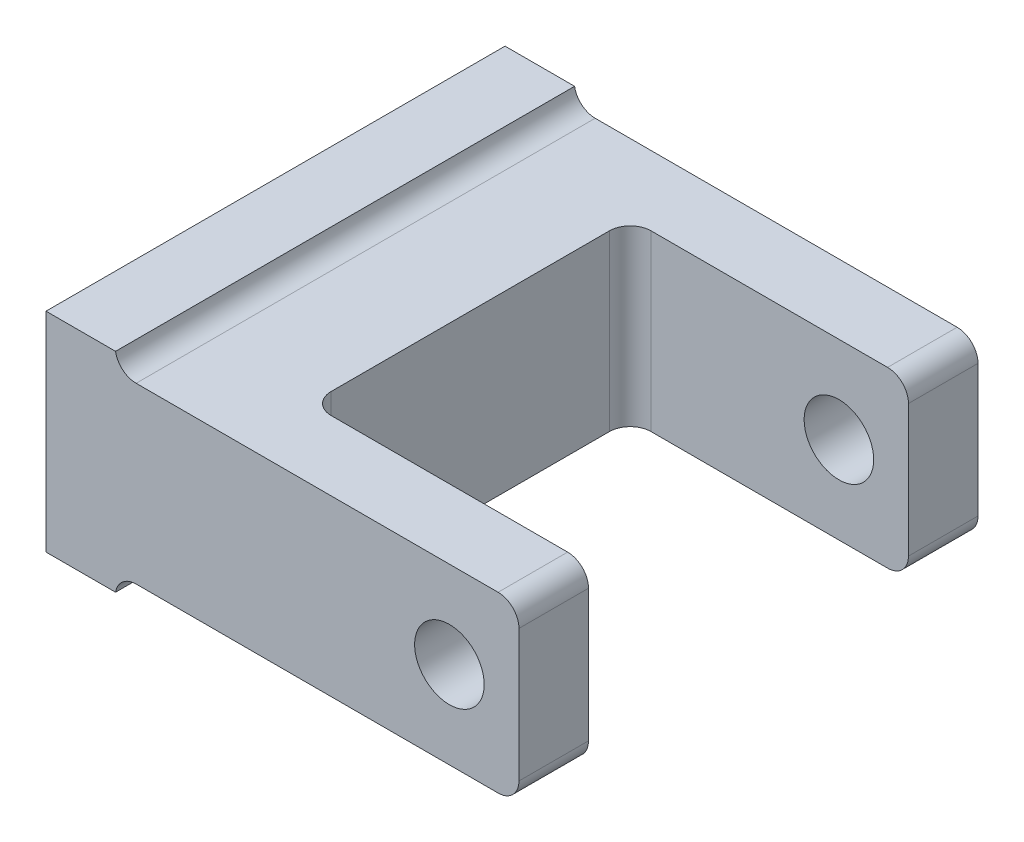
ISO-10303-21;
HEADER;
FILE_DESCRIPTION(('STEP AP214'),'2;1');
FILE_NAME('part.step','',(''),(''),'','','');
FILE_SCHEMA(('AUTOMOTIVE_DESIGN { 1 0 10303 214 1 1 1 1 }'));
ENDSEC;
DATA;
#1=APPLICATION_CONTEXT('core data for automotive mechanical design processes');
#2=APPLICATION_PROTOCOL_DEFINITION('international standard','automotive_design',2000,#1);
#3=PRODUCT_CONTEXT('',#1,'mechanical');
#4=PRODUCT('Part','Part','',(#3));
#5=PRODUCT_RELATED_PRODUCT_CATEGORY('part','',(#4));
#6=PRODUCT_DEFINITION_FORMATION('','',#4);
#7=PRODUCT_DEFINITION_CONTEXT('part definition',#1,'design');
#8=PRODUCT_DEFINITION('design','',#6,#7);
#9=PRODUCT_DEFINITION_SHAPE('','',#8);
#10=(LENGTH_UNIT() NAMED_UNIT(*) SI_UNIT(.MILLI.,.METRE.));
#11=(NAMED_UNIT(*) PLANE_ANGLE_UNIT() SI_UNIT($,.RADIAN.));
#12=(NAMED_UNIT(*) SI_UNIT($,.STERADIAN.) SOLID_ANGLE_UNIT());
#13=UNCERTAINTY_MEASURE_WITH_UNIT(LENGTH_MEASURE(1.E-05),#10,'distance_accuracy_value','');
#14=(GEOMETRIC_REPRESENTATION_CONTEXT(3) GLOBAL_UNCERTAINTY_ASSIGNED_CONTEXT((#13)) GLOBAL_UNIT_ASSIGNED_CONTEXT((#10,
#11,#12)) REPRESENTATION_CONTEXT('',''));
#15=CARTESIAN_POINT('',(0.,0.,0.));
#16=DIRECTION('',(0.,0.,1.));
#17=DIRECTION('',(1.,0.,0.));
#18=AXIS2_PLACEMENT_3D('',#15,#16,#17);
#19=CARTESIAN_POINT('',(34.,12.5,66.));
#20=DIRECTION('',(-1.,0.,0.));
#21=DIRECTION('',(0.,0.,1.));
#22=AXIS2_PLACEMENT_3D('',#19,#20,#21);
#23=PLANE('',#22);
#24=DIRECTION('',(0.,1.,0.));
#25=VECTOR('',#24,1.);
#26=CARTESIAN_POINT('',(34.,12.5,66.));
#27=LINE('',#26,#25);
#28=CARTESIAN_POINT('',(34.,-9.5,66.));
#29=VERTEX_POINT('',#28);
#30=CARTESIAN_POINT('',(34.,9.5,66.));
#31=VERTEX_POINT('',#30);
#32=EDGE_CURVE('E348',#29,#31,#27,.T.);
#33=ORIENTED_EDGE('',*,*,#32,.F.);
#34=DIRECTION('',(0.,0.,-1.));
#35=VECTOR('',#34,1.);
#36=CARTESIAN_POINT('',(34.,-9.5,66.));
#37=LINE('',#36,#35);
#38=CARTESIAN_POINT('',(34.,-9.5,56.));
#39=VERTEX_POINT('',#38);
#40=EDGE_CURVE('E246',#29,#39,#37,.T.);
#41=ORIENTED_EDGE('',*,*,#40,.T.);
#42=DIRECTION('',(0.,-1.,0.));
#43=VECTOR('',#42,1.);
#44=CARTESIAN_POINT('',(34.,12.5,56.));
#45=LINE('',#44,#43);
#46=CARTESIAN_POINT('',(34.,9.5,56.));
#47=VERTEX_POINT('',#46);
#48=EDGE_CURVE('E330',#47,#39,#45,.T.);
#49=ORIENTED_EDGE('',*,*,#48,.F.);
#50=DIRECTION('',(0.,0.,-1.));
#51=VECTOR('',#50,1.);
#52=CARTESIAN_POINT('',(34.,9.5,66.));
#53=LINE('',#52,#51);
#54=EDGE_CURVE('E56',#47,#31,#53,.F.);
#55=ORIENTED_EDGE('',*,*,#54,.T.);
#56=EDGE_LOOP('',(#33,#41,#49,#55));
#57=FACE_BOUND('',#56,.T.);
#58=ADVANCED_FACE('F39',(#57),#23,.F.);
#59=CARTESIAN_POINT('',(-34.,-15.,66.));
#60=DIRECTION('',(1.,0.,0.));
#61=DIRECTION('',(0.,0.,-1.));
#62=AXIS2_PLACEMENT_3D('',#59,#60,#61);
#63=PLANE('',#62);
#64=DIRECTION('',(0.,-1.,0.));
#65=VECTOR('',#64,1.);
#66=CARTESIAN_POINT('',(-34.,-15.,0.));
#67=LINE('',#66,#65);
#68=CARTESIAN_POINT('',(-34.,15.,0.));
#69=VERTEX_POINT('',#68);
#70=CARTESIAN_POINT('',(-34.,-15.,0.));
#71=VERTEX_POINT('',#70);
#72=EDGE_CURVE('E193',#69,#71,#67,.T.);
#73=ORIENTED_EDGE('',*,*,#72,.T.);
#74=DIRECTION('',(0.,0.,-1.));
#75=VECTOR('',#74,1.);
#76=CARTESIAN_POINT('',(-34.,-15.,66.));
#77=LINE('',#76,#75);
#78=CARTESIAN_POINT('',(-34.,-15.,66.));
#79=VERTEX_POINT('',#78);
#80=EDGE_CURVE('E172',#79,#71,#77,.T.);
#81=ORIENTED_EDGE('',*,*,#80,.F.);
#82=DIRECTION('',(0.,-1.,0.));
#83=VECTOR('',#82,1.);
#84=CARTESIAN_POINT('',(-34.,-15.,66.));
#85=LINE('',#84,#83);
#86=CARTESIAN_POINT('',(-34.,15.,66.));
#87=VERTEX_POINT('',#86);
#88=EDGE_CURVE('E179',#87,#79,#85,.T.);
#89=ORIENTED_EDGE('',*,*,#88,.F.);
#90=DIRECTION('',(0.,0.,-1.));
#91=VECTOR('',#90,1.);
#92=CARTESIAN_POINT('',(-34.,15.,66.));
#93=LINE('',#92,#91);
#94=EDGE_CURVE('E357',#87,#69,#93,.T.);
#95=ORIENTED_EDGE('',*,*,#94,.T.);
#96=EDGE_LOOP('',(#73,#81,#89,#95));
#97=FACE_BOUND('',#96,.T.);
#98=ADVANCED_FACE('F191',(#97),#63,.F.);
#99=CARTESIAN_POINT('',(-24.,-15.,66.));
#100=DIRECTION('',(0.,1.,0.));
#101=DIRECTION('',(-1.,0.,0.));
#102=AXIS2_PLACEMENT_3D('',#99,#100,#101);
#103=PLANE('',#102);
#104=DIRECTION('',(1.,0.,0.));
#105=VECTOR('',#104,1.);
#106=CARTESIAN_POINT('',(-24.,-15.,0.));
#107=LINE('',#106,#105);
#108=CARTESIAN_POINT('',(-24.,-15.,0.));
#109=VERTEX_POINT('',#108);
#110=EDGE_CURVE('E360',#71,#109,#107,.T.);
#111=ORIENTED_EDGE('',*,*,#110,.T.);
#112=DIRECTION('',(0.,0.,-1.));
#113=VECTOR('',#112,1.);
#114=CARTESIAN_POINT('',(-24.,-15.,66.));
#115=LINE('',#114,#113);
#116=CARTESIAN_POINT('',(-24.,-15.,66.));
#117=VERTEX_POINT('',#116);
#118=EDGE_CURVE('E175',#117,#109,#115,.T.);
#119=ORIENTED_EDGE('',*,*,#118,.F.);
#120=DIRECTION('',(1.,0.,0.));
#121=VECTOR('',#120,1.);
#122=CARTESIAN_POINT('',(-24.,-15.,66.));
#123=LINE('',#122,#121);
#124=EDGE_CURVE('E167',#79,#117,#123,.T.);
#125=ORIENTED_EDGE('',*,*,#124,.F.);
#126=ORIENTED_EDGE('',*,*,#80,.T.);
#127=EDGE_LOOP('',(#111,#119,#125,#126));
#128=FACE_BOUND('',#127,.T.);
#129=ADVANCED_FACE('F170',(#128),#103,.F.);
#130=CARTESIAN_POINT('',(34.,-12.5,66.));
#131=DIRECTION('',(0.,1.,0.));
#132=DIRECTION('',(-1.,0.,0.));
#133=AXIS2_PLACEMENT_3D('',#130,#131,#132);
#134=PLANE('',#133);
#135=DIRECTION('',(1.,0.,0.));
#136=VECTOR('',#135,1.);
#137=CARTESIAN_POINT('',(34.,-12.5,66.));
#138=LINE('',#137,#136);
#139=CARTESIAN_POINT('',(-21.0419601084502,-12.5,66.));
#140=VERTEX_POINT('',#139);
#141=CARTESIAN_POINT('',(31.,-12.5,66.));
#142=VERTEX_POINT('',#141);
#143=EDGE_CURVE('E178',#140,#142,#138,.T.);
#144=ORIENTED_EDGE('',*,*,#143,.F.);
#145=DIRECTION('',(0.,0.,-1.));
#146=VECTOR('',#145,1.);
#147=CARTESIAN_POINT('',(-21.0419601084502,-12.5,66.));
#148=LINE('',#147,#146);
#149=CARTESIAN_POINT('',(-21.0419601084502,-12.5,0.));
#150=VERTEX_POINT('',#149);
#151=EDGE_CURVE('E207',#140,#150,#148,.T.);
#152=ORIENTED_EDGE('',*,*,#151,.T.);
#153=DIRECTION('',(1.,0.,0.));
#154=VECTOR('',#153,1.);
#155=CARTESIAN_POINT('',(34.,-12.5,0.));
#156=LINE('',#155,#154);
#157=CARTESIAN_POINT('',(31.,-12.5,0.));
#158=VERTEX_POINT('',#157);
#159=EDGE_CURVE('E363',#150,#158,#156,.T.);
#160=ORIENTED_EDGE('',*,*,#159,.T.);
#161=DIRECTION('',(0.,0.,-1.));
#162=VECTOR('',#161,1.);
#163=CARTESIAN_POINT('',(31.,-12.5,66.));
#164=LINE('',#163,#162);
#165=CARTESIAN_POINT('',(31.,-12.5,10.));
#166=VERTEX_POINT('',#165);
#167=EDGE_CURVE('E199',#158,#166,#164,.F.);
#168=ORIENTED_EDGE('',*,*,#167,.T.);
#169=DIRECTION('',(1.,0.,0.));
#170=VECTOR('',#169,1.);
#171=CARTESIAN_POINT('',(-6.,-12.5,10.));
#172=LINE('',#171,#170);
#173=CARTESIAN_POINT('',(-3.,-12.5,10.));
#174=VERTEX_POINT('',#173);
#175=EDGE_CURVE('E310',#174,#166,#172,.T.);
#176=ORIENTED_EDGE('',*,*,#175,.F.);
#177=CARTESIAN_POINT('',(-3.,-12.5,13.));
#178=DIRECTION('',(0.,1.,0.));
#179=DIRECTION('',(-1.,0.,0.));
#180=AXIS2_PLACEMENT_3D('',#177,#178,#179);
#181=CIRCLE('',#180,3.);
#182=CARTESIAN_POINT('',(-6.,-12.5,13.));
#183=VERTEX_POINT('',#182);
#184=EDGE_CURVE('E287',#174,#183,#181,.T.);
#185=ORIENTED_EDGE('',*,*,#184,.T.);
#186=DIRECTION('',(0.,0.,-1.));
#187=VECTOR('',#186,1.);
#188=CARTESIAN_POINT('',(-6.,-12.5,56.));
#189=LINE('',#188,#187);
#190=CARTESIAN_POINT('',(-6.,-12.5,53.));
#191=VERTEX_POINT('',#190);
#192=EDGE_CURVE('E300',#191,#183,#189,.T.);
#193=ORIENTED_EDGE('',*,*,#192,.F.);
#194=CARTESIAN_POINT('',(-3.,-12.5,53.));
#195=DIRECTION('',(0.,1.,0.));
#196=DIRECTION('',(-1.,0.,0.));
#197=AXIS2_PLACEMENT_3D('',#194,#195,#196);
#198=CIRCLE('',#197,3.);
#199=CARTESIAN_POINT('',(-3.,-12.5,56.));
#200=VERTEX_POINT('',#199);
#201=EDGE_CURVE('E49',#191,#200,#198,.T.);
#202=ORIENTED_EDGE('',*,*,#201,.T.);
#203=DIRECTION('',(1.,0.,0.));
#204=VECTOR('',#203,1.);
#205=CARTESIAN_POINT('',(-6.,-12.5,56.));
#206=LINE('',#205,#204);
#207=CARTESIAN_POINT('',(31.,-12.5,56.));
#208=VERTEX_POINT('',#207);
#209=EDGE_CURVE('E297',#200,#208,#206,.T.);
#210=ORIENTED_EDGE('',*,*,#209,.T.);
#211=DIRECTION('',(0.,0.,-1.));
#212=VECTOR('',#211,1.);
#213=CARTESIAN_POINT('',(31.,-12.5,66.));
#214=LINE('',#213,#212);
#215=EDGE_CURVE('E195',#208,#142,#214,.F.);
#216=ORIENTED_EDGE('',*,*,#215,.T.);
#217=EDGE_LOOP('',(#144,#152,#160,#168,#176,#185,#193,#202,#210,#216));
#218=FACE_BOUND('',#217,.T.);
#219=ADVANCED_FACE('F296',(#218),#134,.F.);
#220=DIRECTION('',(0.,1.,0.));
#221=VECTOR('',#220,1.);
#222=CARTESIAN_POINT('',(34.,12.5,10.));
#223=LINE('',#222,#221);
#224=CARTESIAN_POINT('',(34.,-9.5,10.));
#225=VERTEX_POINT('',#224);
#226=CARTESIAN_POINT('',(34.,9.5,10.));
#227=VERTEX_POINT('',#226);
#228=EDGE_CURVE('E326',#225,#227,#223,.T.);
#229=ORIENTED_EDGE('',*,*,#228,.F.);
#230=DIRECTION('',(0.,0.,-1.));
#231=VECTOR('',#230,1.);
#232=CARTESIAN_POINT('',(34.,-9.5,66.));
#233=LINE('',#232,#231);
#234=CARTESIAN_POINT('',(34.,-9.5,0.));
#235=VERTEX_POINT('',#234);
#236=EDGE_CURVE('E225',#225,#235,#233,.T.);
#237=ORIENTED_EDGE('',*,*,#236,.T.);
#238=DIRECTION('',(0.,1.,0.));
#239=VECTOR('',#238,1.);
#240=CARTESIAN_POINT('',(34.,12.5,0.));
#241=LINE('',#240,#239);
#242=CARTESIAN_POINT('',(34.,9.5,0.));
#243=VERTEX_POINT('',#242);
#244=EDGE_CURVE('E367',#235,#243,#241,.T.);
#245=ORIENTED_EDGE('',*,*,#244,.T.);
#246=DIRECTION('',(0.,0.,-1.));
#247=VECTOR('',#246,1.);
#248=CARTESIAN_POINT('',(34.,9.5,66.));
#249=LINE('',#248,#247);
#250=EDGE_CURVE('E222',#243,#227,#249,.F.);
#251=ORIENTED_EDGE('',*,*,#250,.T.);
#252=EDGE_LOOP('',(#229,#237,#245,#251));
#253=FACE_BOUND('',#252,.T.);
#254=ADVANCED_FACE('F415',(#253),#23,.F.);
#255=CARTESIAN_POINT('',(-24.,12.5,66.));
#256=DIRECTION('',(0.,-1.,0.));
#257=DIRECTION('',(1.,0.,0.));
#258=AXIS2_PLACEMENT_3D('',#255,#256,#257);
#259=PLANE('',#258);
#260=DIRECTION('',(-1.,0.,0.));
#261=VECTOR('',#260,1.);
#262=CARTESIAN_POINT('',(-24.,12.5,0.));
#263=LINE('',#262,#261);
#264=CARTESIAN_POINT('',(31.,12.5,0.));
#265=VERTEX_POINT('',#264);
#266=CARTESIAN_POINT('',(-21.0419601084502,12.5,0.));
#267=VERTEX_POINT('',#266);
#268=EDGE_CURVE('E371',#265,#267,#263,.T.);
#269=ORIENTED_EDGE('',*,*,#268,.T.);
#270=DIRECTION('',(0.,0.,1.));
#271=VECTOR('',#270,1.);
#272=CARTESIAN_POINT('',(-21.0419601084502,12.5,66.));
#273=LINE('',#272,#271);
#274=CARTESIAN_POINT('',(-21.0419601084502,12.5,66.));
#275=VERTEX_POINT('',#274);
#276=EDGE_CURVE('E219',#267,#275,#273,.T.);
#277=ORIENTED_EDGE('',*,*,#276,.T.);
#278=DIRECTION('',(-1.,0.,0.));
#279=VECTOR('',#278,1.);
#280=CARTESIAN_POINT('',(-24.,12.5,66.));
#281=LINE('',#280,#279);
#282=CARTESIAN_POINT('',(31.,12.5,66.));
#283=VERTEX_POINT('',#282);
#284=EDGE_CURVE('E351',#283,#275,#281,.T.);
#285=ORIENTED_EDGE('',*,*,#284,.F.);
#286=DIRECTION('',(0.,0.,-1.));
#287=VECTOR('',#286,1.);
#288=CARTESIAN_POINT('',(31.,12.5,66.));
#289=LINE('',#288,#287);
#290=CARTESIAN_POINT('',(31.,12.5,56.));
#291=VERTEX_POINT('',#290);
#292=EDGE_CURVE('E215',#283,#291,#289,.T.);
#293=ORIENTED_EDGE('',*,*,#292,.T.);
#294=DIRECTION('',(1.,0.,0.));
#295=VECTOR('',#294,1.);
#296=CARTESIAN_POINT('',(-6.,12.5,56.));
#297=LINE('',#296,#295);
#298=CARTESIAN_POINT('',(-3.,12.5,56.));
#299=VERTEX_POINT('',#298);
#300=EDGE_CURVE('E319',#299,#291,#297,.T.);
#301=ORIENTED_EDGE('',*,*,#300,.F.);
#302=CARTESIAN_POINT('',(-3.,12.5,53.));
#303=DIRECTION('',(0.,-1.,0.));
#304=DIRECTION('',(1.,0.,0.));
#305=AXIS2_PLACEMENT_3D('',#302,#303,#304);
#306=CIRCLE('',#305,3.);
#307=CARTESIAN_POINT('',(-6.,12.5,53.));
#308=VERTEX_POINT('',#307);
#309=EDGE_CURVE('E11',#299,#308,#306,.T.);
#310=ORIENTED_EDGE('',*,*,#309,.T.);
#311=DIRECTION('',(0.,0.,1.));
#312=VECTOR('',#311,1.);
#313=CARTESIAN_POINT('',(-6.,12.5,56.));
#314=LINE('',#313,#312);
#315=CARTESIAN_POINT('',(-6.,12.5,13.));
#316=VERTEX_POINT('',#315);
#317=EDGE_CURVE('E311',#316,#308,#314,.T.);
#318=ORIENTED_EDGE('',*,*,#317,.F.);
#319=CARTESIAN_POINT('',(-3.,12.5,13.));
#320=DIRECTION('',(0.,-1.,0.));
#321=DIRECTION('',(1.,0.,0.));
#322=AXIS2_PLACEMENT_3D('',#319,#320,#321);
#323=CIRCLE('',#322,3.);
#324=CARTESIAN_POINT('',(-3.,12.5,10.));
#325=VERTEX_POINT('',#324);
#326=EDGE_CURVE('E284',#316,#325,#323,.T.);
#327=ORIENTED_EDGE('',*,*,#326,.T.);
#328=DIRECTION('',(1.,0.,0.));
#329=VECTOR('',#328,1.);
#330=CARTESIAN_POINT('',(-6.,12.5,10.));
#331=LINE('',#330,#329);
#332=CARTESIAN_POINT('',(31.,12.5,10.));
#333=VERTEX_POINT('',#332);
#334=EDGE_CURVE('E339',#325,#333,#331,.T.);
#335=ORIENTED_EDGE('',*,*,#334,.T.);
#336=DIRECTION('',(0.,0.,-1.));
#337=VECTOR('',#336,1.);
#338=CARTESIAN_POINT('',(31.,12.5,66.));
#339=LINE('',#338,#337);
#340=EDGE_CURVE('E211',#333,#265,#339,.T.);
#341=ORIENTED_EDGE('',*,*,#340,.T.);
#342=EDGE_LOOP('',(#269,#277,#285,#293,#301,#310,#318,#327,#335,#341));
#343=FACE_BOUND('',#342,.T.);
#344=ADVANCED_FACE('F318',(#343),#259,.F.);
#345=CARTESIAN_POINT('',(-34.,15.,66.));
#346=DIRECTION('',(0.,-1.,0.));
#347=DIRECTION('',(0.,0.,-1.));
#348=AXIS2_PLACEMENT_3D('',#345,#346,#347);
#349=PLANE('',#348);
#350=DIRECTION('',(-1.,0.,0.));
#351=VECTOR('',#350,1.);
#352=CARTESIAN_POINT('',(-34.,15.,0.));
#353=LINE('',#352,#351);
#354=CARTESIAN_POINT('',(-24.,15.,0.));
#355=VERTEX_POINT('',#354);
#356=EDGE_CURVE('E189',#355,#69,#353,.T.);
#357=ORIENTED_EDGE('',*,*,#356,.T.);
#358=ORIENTED_EDGE('',*,*,#94,.F.);
#359=DIRECTION('',(-1.,0.,0.));
#360=VECTOR('',#359,1.);
#361=CARTESIAN_POINT('',(-34.,15.,66.));
#362=LINE('',#361,#360);
#363=CARTESIAN_POINT('',(-24.,15.,66.));
#364=VERTEX_POINT('',#363);
#365=EDGE_CURVE('E184',#364,#87,#362,.T.);
#366=ORIENTED_EDGE('',*,*,#365,.F.);
#367=DIRECTION('',(0.,0.,-1.));
#368=VECTOR('',#367,1.);
#369=CARTESIAN_POINT('',(-24.,15.,66.));
#370=LINE('',#369,#368);
#371=EDGE_CURVE('E201',#364,#355,#370,.T.);
#372=ORIENTED_EDGE('',*,*,#371,.T.);
#373=EDGE_LOOP('',(#357,#358,#366,#372));
#374=FACE_BOUND('',#373,.T.);
#375=ADVANCED_FACE('F382',(#374),#349,.F.);
#376=CARTESIAN_POINT('',(0.,0.,66.));
#377=DIRECTION('',(0.,0.,-1.));
#378=DIRECTION('',(-1.,0.,0.));
#379=AXIS2_PLACEMENT_3D('',#376,#377,#378);
#380=PLANE('',#379);
#381=CARTESIAN_POINT('',(24.,0.,66.));
#382=DIRECTION('',(0.,0.,1.));
#383=DIRECTION('',(1.,0.,0.));
#384=AXIS2_PLACEMENT_3D('',#381,#382,#383);
#385=CIRCLE('',#384,5.);
#386=CARTESIAN_POINT('',(29.,0.,66.));
#387=VERTEX_POINT('',#386);
#388=EDGE_CURVE('E607',#387,#387,#385,.T.);
#389=ORIENTED_EDGE('',*,*,#388,.F.);
#390=EDGE_LOOP('',(#389));
#391=FACE_BOUND('',#390,.T.);
#392=ORIENTED_EDGE('',*,*,#143,.T.);
#393=CARTESIAN_POINT('',(31.,-9.5,66.));
#394=DIRECTION('',(0.,0.,-1.));
#395=DIRECTION('',(-1.,0.,0.));
#396=AXIS2_PLACEMENT_3D('',#393,#394,#395);
#397=CIRCLE('',#396,3.);
#398=EDGE_CURVE('E63',#142,#29,#397,.F.);
#399=ORIENTED_EDGE('',*,*,#398,.T.);
#400=ORIENTED_EDGE('',*,*,#32,.T.);
#401=CARTESIAN_POINT('',(31.,9.5,66.));
#402=DIRECTION('',(0.,0.,-1.));
#403=DIRECTION('',(-1.,0.,0.));
#404=AXIS2_PLACEMENT_3D('',#401,#402,#403);
#405=CIRCLE('',#404,3.);
#406=EDGE_CURVE('E259',#31,#283,#405,.F.);
#407=ORIENTED_EDGE('',*,*,#406,.T.);
#408=ORIENTED_EDGE('',*,*,#284,.T.);
#409=CARTESIAN_POINT('',(-21.0419601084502,15.5,66.));
#410=DIRECTION('',(0.,0.,-1.));
#411=DIRECTION('',(-1.,0.,0.));
#412=AXIS2_PLACEMENT_3D('',#409,#410,#411);
#413=CIRCLE('',#412,3.);
#414=EDGE_CURVE('E281',#275,#364,#413,.T.);
#415=ORIENTED_EDGE('',*,*,#414,.T.);
#416=ORIENTED_EDGE('',*,*,#365,.T.);
#417=ORIENTED_EDGE('',*,*,#88,.T.);
#418=ORIENTED_EDGE('',*,*,#124,.T.);
#419=CARTESIAN_POINT('',(-21.0419601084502,-15.5,66.));
#420=DIRECTION('',(0.,0.,-1.));
#421=DIRECTION('',(-1.,0.,0.));
#422=AXIS2_PLACEMENT_3D('',#419,#420,#421);
#423=CIRCLE('',#422,3.);
#424=EDGE_CURVE('E275',#117,#140,#423,.T.);
#425=ORIENTED_EDGE('',*,*,#424,.T.);
#426=EDGE_LOOP('',(#392,#399,#400,#407,#408,#415,#416,#417,#418,#425));
#427=FACE_BOUND('',#426,.T.);
#428=ADVANCED_FACE('F182',(#391,#427),#380,.F.);
#429=CARTESIAN_POINT('',(0.,0.,0.));
#430=DIRECTION('',(0.,0.,-1.));
#431=DIRECTION('',(-1.,0.,0.));
#432=AXIS2_PLACEMENT_3D('',#429,#430,#431);
#433=PLANE('',#432);
#434=CARTESIAN_POINT('',(24.,0.,0.));
#435=DIRECTION('',(0.,0.,1.));
#436=DIRECTION('',(1.,0.,0.));
#437=AXIS2_PLACEMENT_3D('',#434,#435,#436);
#438=CIRCLE('',#437,5.);
#439=CARTESIAN_POINT('',(29.,0.,0.));
#440=VERTEX_POINT('',#439);
#441=EDGE_CURVE('E613',#440,#440,#438,.T.);
#442=ORIENTED_EDGE('',*,*,#441,.T.);
#443=EDGE_LOOP('',(#442));
#444=FACE_BOUND('',#443,.T.);
#445=ORIENTED_EDGE('',*,*,#244,.F.);
#446=CARTESIAN_POINT('',(31.,-9.5,0.));
#447=DIRECTION('',(0.,0.,-1.));
#448=DIRECTION('',(-1.,0.,0.));
#449=AXIS2_PLACEMENT_3D('',#446,#447,#448);
#450=CIRCLE('',#449,3.);
#451=EDGE_CURVE('E232',#235,#158,#450,.T.);
#452=ORIENTED_EDGE('',*,*,#451,.T.);
#453=ORIENTED_EDGE('',*,*,#159,.F.);
#454=CARTESIAN_POINT('',(-21.0419601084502,-15.5,0.));
#455=DIRECTION('',(0.,0.,-1.));
#456=DIRECTION('',(-1.,0.,0.));
#457=AXIS2_PLACEMENT_3D('',#454,#455,#456);
#458=CIRCLE('',#457,3.);
#459=EDGE_CURVE('E272',#150,#109,#458,.F.);
#460=ORIENTED_EDGE('',*,*,#459,.T.);
#461=ORIENTED_EDGE('',*,*,#110,.F.);
#462=ORIENTED_EDGE('',*,*,#72,.F.);
#463=ORIENTED_EDGE('',*,*,#356,.F.);
#464=CARTESIAN_POINT('',(-21.0419601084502,15.5,0.));
#465=DIRECTION('',(0.,0.,-1.));
#466=DIRECTION('',(-1.,0.,0.));
#467=AXIS2_PLACEMENT_3D('',#464,#465,#466);
#468=CIRCLE('',#467,3.);
#469=EDGE_CURVE('E278',#355,#267,#468,.F.);
#470=ORIENTED_EDGE('',*,*,#469,.T.);
#471=ORIENTED_EDGE('',*,*,#268,.F.);
#472=CARTESIAN_POINT('',(31.,9.5,0.));
#473=DIRECTION('',(0.,0.,-1.));
#474=DIRECTION('',(-1.,0.,0.));
#475=AXIS2_PLACEMENT_3D('',#472,#473,#474);
#476=CIRCLE('',#475,3.);
#477=EDGE_CURVE('E229',#265,#243,#476,.T.);
#478=ORIENTED_EDGE('',*,*,#477,.T.);
#479=EDGE_LOOP('',(#445,#452,#453,#460,#461,#462,#463,#470,#471,#478));
#480=FACE_BOUND('',#479,.T.);
#481=ADVANCED_FACE('F387',(#444,#480),#433,.T.);
#482=CARTESIAN_POINT('',(-6.,12.5,56.));
#483=DIRECTION('',(0.,0.,1.));
#484=DIRECTION('',(0.,-1.,0.));
#485=AXIS2_PLACEMENT_3D('',#482,#483,#484);
#486=PLANE('',#485);
#487=CARTESIAN_POINT('',(24.,0.,56.));
#488=DIRECTION('',(0.,0.,1.));
#489=DIRECTION('',(0.,-1.,0.));
#490=AXIS2_PLACEMENT_3D('',#487,#488,#489);
#491=CIRCLE('',#490,5.);
#492=CARTESIAN_POINT('',(24.,-5.00000000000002,56.));
#493=VERTEX_POINT('',#492);
#494=EDGE_CURVE('E333',#493,#493,#491,.T.);
#495=ORIENTED_EDGE('',*,*,#494,.T.);
#496=EDGE_LOOP('',(#495));
#497=FACE_BOUND('',#496,.T.);
#498=ORIENTED_EDGE('',*,*,#48,.T.);
#499=CARTESIAN_POINT('',(31.,-9.5,56.));
#500=DIRECTION('',(0.,0.,1.));
#501=DIRECTION('',(0.,-1.,0.));
#502=AXIS2_PLACEMENT_3D('',#499,#500,#501);
#503=CIRCLE('',#502,3.);
#504=EDGE_CURVE('E256',#39,#208,#503,.F.);
#505=ORIENTED_EDGE('',*,*,#504,.T.);
#506=ORIENTED_EDGE('',*,*,#209,.F.);
#507=DIRECTION('',(0.,-1.,0.));
#508=VECTOR('',#507,1.);
#509=CARTESIAN_POINT('',(-3.,12.5,56.));
#510=LINE('',#509,#508);
#511=EDGE_CURVE('E250',#200,#299,#510,.F.);
#512=ORIENTED_EDGE('',*,*,#511,.T.);
#513=ORIENTED_EDGE('',*,*,#300,.T.);
#514=CARTESIAN_POINT('',(31.,9.5,56.));
#515=DIRECTION('',(0.,0.,1.));
#516=DIRECTION('',(0.,-1.,0.));
#517=AXIS2_PLACEMENT_3D('',#514,#515,#516);
#518=CIRCLE('',#517,3.);
#519=EDGE_CURVE('E253',#291,#47,#518,.F.);
#520=ORIENTED_EDGE('',*,*,#519,.T.);
#521=EDGE_LOOP('',(#498,#505,#506,#512,#513,#520));
#522=FACE_BOUND('',#521,.T.);
#523=ADVANCED_FACE('F306',(#497,#522),#486,.F.);
#524=CARTESIAN_POINT('',(-6.,12.5,10.));
#525=DIRECTION('',(0.,0.,-1.));
#526=DIRECTION('',(-1.,0.,0.));
#527=AXIS2_PLACEMENT_3D('',#524,#525,#526);
#528=PLANE('',#527);
#529=CARTESIAN_POINT('',(24.,0.,10.));
#530=DIRECTION('',(0.,0.,-1.));
#531=DIRECTION('',(-1.,0.,0.));
#532=AXIS2_PLACEMENT_3D('',#529,#530,#531);
#533=CIRCLE('',#532,5.);
#534=CARTESIAN_POINT('',(19.,0.,10.));
#535=VERTEX_POINT('',#534);
#536=EDGE_CURVE('E43',#535,#535,#533,.T.);
#537=ORIENTED_EDGE('',*,*,#536,.T.);
#538=EDGE_LOOP('',(#537));
#539=FACE_BOUND('',#538,.T.);
#540=ORIENTED_EDGE('',*,*,#175,.T.);
#541=CARTESIAN_POINT('',(31.,-9.5,10.));
#542=DIRECTION('',(0.,0.,-1.));
#543=DIRECTION('',(-1.,0.,0.));
#544=AXIS2_PLACEMENT_3D('',#541,#542,#543);
#545=CIRCLE('',#544,3.);
#546=EDGE_CURVE('E241',#166,#225,#545,.F.);
#547=ORIENTED_EDGE('',*,*,#546,.T.);
#548=ORIENTED_EDGE('',*,*,#228,.T.);
#549=CARTESIAN_POINT('',(31.,9.5,10.));
#550=DIRECTION('',(0.,0.,-1.));
#551=DIRECTION('',(-1.,0.,0.));
#552=AXIS2_PLACEMENT_3D('',#549,#550,#551);
#553=CIRCLE('',#552,3.);
#554=EDGE_CURVE('E238',#227,#333,#553,.F.);
#555=ORIENTED_EDGE('',*,*,#554,.T.);
#556=ORIENTED_EDGE('',*,*,#334,.F.);
#557=DIRECTION('',(0.,1.,0.));
#558=VECTOR('',#557,1.);
#559=CARTESIAN_POINT('',(-3.,12.5,10.));
#560=LINE('',#559,#558);
#561=EDGE_CURVE('E235',#325,#174,#560,.F.);
#562=ORIENTED_EDGE('',*,*,#561,.T.);
#563=EDGE_LOOP('',(#540,#547,#548,#555,#556,#562));
#564=FACE_BOUND('',#563,.T.);
#565=ADVANCED_FACE('F437',(#539,#564),#528,.F.);
#566=CARTESIAN_POINT('',(-6.,0.,0.));
#567=DIRECTION('',(1.,0.,0.));
#568=DIRECTION('',(0.,0.,-1.));
#569=AXIS2_PLACEMENT_3D('',#566,#567,#568);
#570=PLANE('',#569);
#571=ORIENTED_EDGE('',*,*,#192,.T.);
#572=DIRECTION('',(0.,1.,0.));
#573=VECTOR('',#572,1.);
#574=CARTESIAN_POINT('',(-6.,0.,13.));
#575=LINE('',#574,#573);
#576=EDGE_CURVE('E268',#183,#316,#575,.T.);
#577=ORIENTED_EDGE('',*,*,#576,.T.);
#578=ORIENTED_EDGE('',*,*,#317,.T.);
#579=DIRECTION('',(0.,-1.,0.));
#580=VECTOR('',#579,1.);
#581=CARTESIAN_POINT('',(-6.,0.,53.));
#582=LINE('',#581,#580);
#583=EDGE_CURVE('E264',#308,#191,#582,.T.);
#584=ORIENTED_EDGE('',*,*,#583,.T.);
#585=EDGE_LOOP('',(#571,#577,#578,#584));
#586=FACE_BOUND('',#585,.T.);
#587=ADVANCED_FACE('F321',(#586),#570,.T.);
#588=CARTESIAN_POINT('',(-21.0419601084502,-15.5,66.));
#589=DIRECTION('',(0.,0.,-1.));
#590=DIRECTION('',(-1.,0.,0.));
#591=AXIS2_PLACEMENT_3D('',#588,#589,#590);
#592=CYLINDRICAL_SURFACE('',#591,3.);
#593=ORIENTED_EDGE('',*,*,#424,.F.);
#594=ORIENTED_EDGE('',*,*,#118,.T.);
#595=ORIENTED_EDGE('',*,*,#459,.F.);
#596=ORIENTED_EDGE('',*,*,#151,.F.);
#597=EDGE_LOOP('',(#593,#594,#595,#596));
#598=FACE_BOUND('',#597,.T.);
#599=ADVANCED_FACE('F391',(#598),#592,.F.);
#600=CARTESIAN_POINT('',(-21.0419601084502,15.5,66.));
#601=DIRECTION('',(0.,0.,1.));
#602=DIRECTION('',(1.,0.,0.));
#603=AXIS2_PLACEMENT_3D('',#600,#601,#602);
#604=CYLINDRICAL_SURFACE('',#603,3.);
#605=ORIENTED_EDGE('',*,*,#414,.F.);
#606=ORIENTED_EDGE('',*,*,#276,.F.);
#607=ORIENTED_EDGE('',*,*,#469,.F.);
#608=ORIENTED_EDGE('',*,*,#371,.F.);
#609=EDGE_LOOP('',(#605,#606,#607,#608));
#610=FACE_BOUND('',#609,.T.);
#611=ADVANCED_FACE('F402',(#610),#604,.F.);
#612=CARTESIAN_POINT('',(31.,-9.5,66.));
#613=DIRECTION('',(0.,0.,-1.));
#614=DIRECTION('',(-1.,0.,0.));
#615=AXIS2_PLACEMENT_3D('',#612,#613,#614);
#616=CYLINDRICAL_SURFACE('',#615,3.);
#617=ORIENTED_EDGE('',*,*,#546,.F.);
#618=ORIENTED_EDGE('',*,*,#167,.F.);
#619=ORIENTED_EDGE('',*,*,#451,.F.);
#620=ORIENTED_EDGE('',*,*,#236,.F.);
#621=EDGE_LOOP('',(#617,#618,#619,#620));
#622=FACE_BOUND('',#621,.T.);
#623=ADVANCED_FACE('F404',(#622),#616,.T.);
#624=CARTESIAN_POINT('',(31.,-9.5,66.));
#625=DIRECTION('',(0.,0.,-1.));
#626=DIRECTION('',(-1.,0.,0.));
#627=AXIS2_PLACEMENT_3D('',#624,#625,#626);
#628=CYLINDRICAL_SURFACE('',#627,3.);
#629=ORIENTED_EDGE('',*,*,#398,.F.);
#630=ORIENTED_EDGE('',*,*,#215,.F.);
#631=ORIENTED_EDGE('',*,*,#504,.F.);
#632=ORIENTED_EDGE('',*,*,#40,.F.);
#633=EDGE_LOOP('',(#629,#630,#631,#632));
#634=FACE_BOUND('',#633,.T.);
#635=ADVANCED_FACE('F394',(#634),#628,.T.);
#636=CARTESIAN_POINT('',(31.,9.5,66.));
#637=DIRECTION('',(0.,0.,-1.));
#638=DIRECTION('',(-1.,0.,0.));
#639=AXIS2_PLACEMENT_3D('',#636,#637,#638);
#640=CYLINDRICAL_SURFACE('',#639,3.);
#641=ORIENTED_EDGE('',*,*,#406,.F.);
#642=ORIENTED_EDGE('',*,*,#54,.F.);
#643=ORIENTED_EDGE('',*,*,#519,.F.);
#644=ORIENTED_EDGE('',*,*,#292,.F.);
#645=EDGE_LOOP('',(#641,#642,#643,#644));
#646=FACE_BOUND('',#645,.T.);
#647=ADVANCED_FACE('F399',(#646),#640,.T.);
#648=CARTESIAN_POINT('',(31.,9.5,66.));
#649=DIRECTION('',(0.,0.,-1.));
#650=DIRECTION('',(-1.,0.,0.));
#651=AXIS2_PLACEMENT_3D('',#648,#649,#650);
#652=CYLINDRICAL_SURFACE('',#651,3.);
#653=ORIENTED_EDGE('',*,*,#554,.F.);
#654=ORIENTED_EDGE('',*,*,#250,.F.);
#655=ORIENTED_EDGE('',*,*,#477,.F.);
#656=ORIENTED_EDGE('',*,*,#340,.F.);
#657=EDGE_LOOP('',(#653,#654,#655,#656));
#658=FACE_BOUND('',#657,.T.);
#659=ADVANCED_FACE('F444',(#658),#652,.T.);
#660=CARTESIAN_POINT('',(-3.,0.,13.));
#661=DIRECTION('',(0.,1.,0.));
#662=DIRECTION('',(0.,0.,1.));
#663=AXIS2_PLACEMENT_3D('',#660,#661,#662);
#664=CYLINDRICAL_SURFACE('',#663,3.);
#665=ORIENTED_EDGE('',*,*,#184,.F.);
#666=ORIENTED_EDGE('',*,*,#561,.F.);
#667=ORIENTED_EDGE('',*,*,#326,.F.);
#668=ORIENTED_EDGE('',*,*,#576,.F.);
#669=EDGE_LOOP('',(#665,#666,#667,#668));
#670=FACE_BOUND('',#669,.T.);
#671=ADVANCED_FACE('F441',(#670),#664,.F.);
#672=CARTESIAN_POINT('',(-3.,0.,53.));
#673=DIRECTION('',(0.,-1.,0.));
#674=DIRECTION('',(0.,0.,-1.));
#675=AXIS2_PLACEMENT_3D('',#672,#673,#674);
#676=CYLINDRICAL_SURFACE('',#675,3.);
#677=ORIENTED_EDGE('',*,*,#309,.F.);
#678=ORIENTED_EDGE('',*,*,#511,.F.);
#679=ORIENTED_EDGE('',*,*,#201,.F.);
#680=ORIENTED_EDGE('',*,*,#583,.F.);
#681=EDGE_LOOP('',(#677,#678,#679,#680));
#682=FACE_BOUND('',#681,.T.);
#683=ADVANCED_FACE('F41',(#682),#676,.F.);
#684=CARTESIAN_POINT('',(24.,0.,0.));
#685=DIRECTION('',(0.,0.,1.));
#686=DIRECTION('',(1.,0.,0.));
#687=AXIS2_PLACEMENT_3D('',#684,#685,#686);
#688=CYLINDRICAL_SURFACE('',#687,5.);
#689=ORIENTED_EDGE('',*,*,#441,.F.);
#690=EDGE_LOOP('',(#689));
#691=FACE_BOUND('',#690,.T.);
#692=ORIENTED_EDGE('',*,*,#536,.F.);
#693=EDGE_LOOP('',(#692));
#694=FACE_BOUND('',#693,.T.);
#695=ADVANCED_FACE('F481',(#691,#694),#688,.F.);
#696=ORIENTED_EDGE('',*,*,#388,.T.);
#697=EDGE_LOOP('',(#696));
#698=FACE_BOUND('',#697,.T.);
#699=ORIENTED_EDGE('',*,*,#494,.F.);
#700=EDGE_LOOP('',(#699));
#701=FACE_BOUND('',#700,.T.);
#702=ADVANCED_FACE('F530',(#698,#701),#688,.F.);
#703=CLOSED_SHELL('',(#58,#98,#129,#219,#254,#344,#375,#428,#481,#523,#565,#587,#599,#611,#623,
#635,#647,#659,#671,#683,#695,#702));
#704=MANIFOLD_SOLID_BREP('B2',#703);
#705=ADVANCED_BREP_SHAPE_REPRESENTATION('',(#18,#704),#14);
#706=SHAPE_DEFINITION_REPRESENTATION(#9,#705);
ENDSEC;
END-ISO-10303-21;
